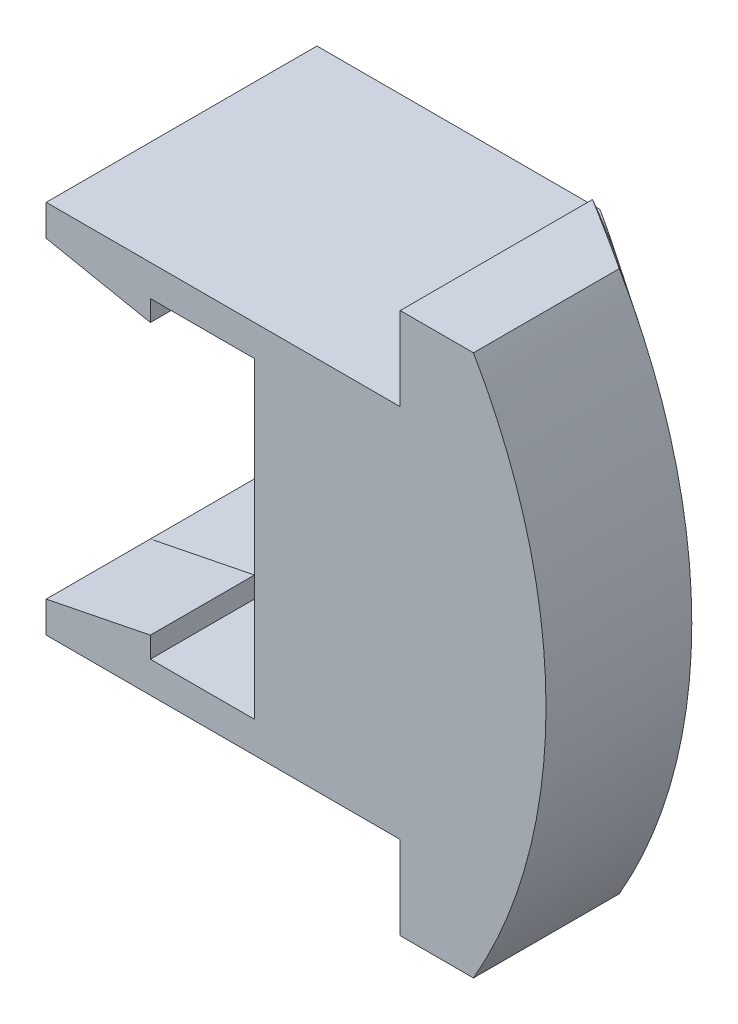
ISO-10303-21;
HEADER;
FILE_DESCRIPTION(('STEP AP214'),'2;1');
FILE_NAME('part.step','',(''),(''),'','','');
FILE_SCHEMA(('AUTOMOTIVE_DESIGN { 1 0 10303 214 1 1 1 1 }'));
ENDSEC;
DATA;
#1=APPLICATION_CONTEXT('core data for automotive mechanical design processes');
#2=APPLICATION_PROTOCOL_DEFINITION('international standard','automotive_design',2000,#1);
#3=PRODUCT_CONTEXT('',#1,'mechanical');
#4=PRODUCT('Part','Part','',(#3));
#5=PRODUCT_RELATED_PRODUCT_CATEGORY('part','',(#4));
#6=PRODUCT_DEFINITION_FORMATION('','',#4);
#7=PRODUCT_DEFINITION_CONTEXT('part definition',#1,'design');
#8=PRODUCT_DEFINITION('design','',#6,#7);
#9=PRODUCT_DEFINITION_SHAPE('','',#8);
#10=(LENGTH_UNIT() NAMED_UNIT(*) SI_UNIT(.MILLI.,.METRE.));
#11=(NAMED_UNIT(*) PLANE_ANGLE_UNIT() SI_UNIT($,.RADIAN.));
#12=(NAMED_UNIT(*) SI_UNIT($,.STERADIAN.) SOLID_ANGLE_UNIT());
#13=UNCERTAINTY_MEASURE_WITH_UNIT(LENGTH_MEASURE(1.E-05),#10,'distance_accuracy_value','');
#14=(GEOMETRIC_REPRESENTATION_CONTEXT(3) GLOBAL_UNCERTAINTY_ASSIGNED_CONTEXT((#13)) GLOBAL_UNIT_ASSIGNED_CONTEXT((#10,
#11,#12)) REPRESENTATION_CONTEXT('',''));
#15=CARTESIAN_POINT('',(0.,0.,0.));
#16=DIRECTION('',(0.,0.,1.));
#17=DIRECTION('',(1.,0.,0.));
#18=AXIS2_PLACEMENT_3D('',#15,#16,#17);
#19=CARTESIAN_POINT('',(-44.,-15.5,11.5));
#20=DIRECTION('',(0.,0.,1.));
#21=DIRECTION('',(1.,0.,0.));
#22=AXIS2_PLACEMENT_3D('',#19,#20,#21);
#23=PLANE('',#22);
#24=DIRECTION('',(-1.,0.,0.));
#25=VECTOR('',#24,1.);
#26=CARTESIAN_POINT('',(-44.,-13.5,11.5));
#27=LINE('',#26,#25);
#28=CARTESIAN_POINT('',(-19.5817691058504,-13.5,11.5));
#29=VERTEX_POINT('',#28);
#30=CARTESIAN_POINT('',(-30.5,-13.5,11.5));
#31=VERTEX_POINT('',#30);
#32=EDGE_CURVE('E406',#29,#31,#27,.T.);
#33=ORIENTED_EDGE('',*,*,#32,.F.);
#34=CARTESIAN_POINT('',(-44.,-15.5,11.5));
#35=DIRECTION('',(0.,0.,1.));
#36=DIRECTION('',(1.,0.,0.));
#37=AXIS2_PLACEMENT_3D('',#34,#35,#36);
#38=CIRCLE('',#37,24.5);
#39=CARTESIAN_POINT('',(-19.5204166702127,-16.5,11.5));
#40=VERTEX_POINT('',#39);
#41=EDGE_CURVE('E479',#40,#29,#38,.T.);
#42=ORIENTED_EDGE('',*,*,#41,.F.);
#43=DIRECTION('',(-1.,0.,0.));
#44=VECTOR('',#43,1.);
#45=CARTESIAN_POINT('',(-44.,-16.5,11.5));
#46=LINE('',#45,#44);
#47=CARTESIAN_POINT('',(-30.5,-16.5,11.5));
#48=VERTEX_POINT('',#47);
#49=EDGE_CURVE('E446',#40,#48,#46,.T.);
#50=ORIENTED_EDGE('',*,*,#49,.T.);
#51=DIRECTION('',(0.,1.,0.));
#52=VECTOR('',#51,1.);
#53=CARTESIAN_POINT('',(-30.5,-8.,11.5));
#54=LINE('',#53,#52);
#55=EDGE_CURVE('E494',#48,#31,#54,.T.);
#56=ORIENTED_EDGE('',*,*,#55,.T.);
#57=EDGE_LOOP('',(#33,#42,#50,#56));
#58=FACE_BOUND('',#57,.T.);
#59=ADVANCED_FACE('F33',(#58),#23,.F.);
#60=CARTESIAN_POINT('',(-30.5,-8.,13.));
#61=DIRECTION('',(-1.,0.,0.));
#62=DIRECTION('',(0.,-1.,0.));
#63=AXIS2_PLACEMENT_3D('',#60,#61,#62);
#64=PLANE('',#63);
#65=DIRECTION('',(0.,0.,-1.));
#66=VECTOR('',#65,1.);
#67=CARTESIAN_POINT('',(-30.5,-13.5,13.));
#68=LINE('',#67,#66);
#69=CARTESIAN_POINT('',(-30.5,-13.5,0.));
#70=VERTEX_POINT('',#69);
#71=EDGE_CURVE('E42',#31,#70,#68,.T.);
#72=ORIENTED_EDGE('',*,*,#71,.F.);
#73=ORIENTED_EDGE('',*,*,#55,.F.);
#74=DIRECTION('',(0.,0.,-1.));
#75=VECTOR('',#74,1.);
#76=CARTESIAN_POINT('',(-30.5,-16.5,13.));
#77=LINE('',#76,#75);
#78=CARTESIAN_POINT('',(-30.5,-16.5,0.));
#79=VERTEX_POINT('',#78);
#80=EDGE_CURVE('E396',#48,#79,#77,.T.);
#81=ORIENTED_EDGE('',*,*,#80,.T.);
#82=DIRECTION('',(0.,-1.,0.));
#83=VECTOR('',#82,1.);
#84=CARTESIAN_POINT('',(-30.5,-15.5,0.));
#85=LINE('',#84,#83);
#86=EDGE_CURVE('E499',#70,#79,#85,.T.);
#87=ORIENTED_EDGE('',*,*,#86,.F.);
#88=EDGE_LOOP('',(#72,#73,#81,#87));
#89=FACE_BOUND('',#88,.T.);
#90=ADVANCED_FACE('F587',(#89),#64,.F.);
#91=DIRECTION('',(-1.,0.,0.));
#92=VECTOR('',#91,1.);
#93=CARTESIAN_POINT('',(-44.,-18.,11.5));
#94=LINE('',#93,#92);
#95=CARTESIAN_POINT('',(-19.6278847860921,-18.,11.5));
#96=VERTEX_POINT('',#95);
#97=CARTESIAN_POINT('',(-30.5,-18.,11.5));
#98=VERTEX_POINT('',#97);
#99=EDGE_CURVE('E441',#96,#98,#94,.T.);
#100=ORIENTED_EDGE('',*,*,#99,.F.);
#101=CARTESIAN_POINT('',(-22.366692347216,-27.,11.5));
#102=VERTEX_POINT('',#101);
#103=EDGE_CURVE('E475',#102,#96,#38,.T.);
#104=ORIENTED_EDGE('',*,*,#103,.F.);
#105=DIRECTION('',(1.,0.,0.));
#106=VECTOR('',#105,1.);
#107=CARTESIAN_POINT('',(-25.,-27.,11.5));
#108=LINE('',#107,#106);
#109=CARTESIAN_POINT('',(-23.5,-27.,11.5));
#110=VERTEX_POINT('',#109);
#111=EDGE_CURVE('E467',#110,#102,#108,.T.);
#112=ORIENTED_EDGE('',*,*,#111,.F.);
#113=DIRECTION('',(0.,-1.,0.));
#114=VECTOR('',#113,1.);
#115=CARTESIAN_POINT('',(-23.5,-24.5,11.5));
#116=LINE('',#115,#114);
#117=CARTESIAN_POINT('',(-23.5,-23.,11.5));
#118=VERTEX_POINT('',#117);
#119=EDGE_CURVE('E461',#118,#110,#116,.T.);
#120=ORIENTED_EDGE('',*,*,#119,.F.);
#121=DIRECTION('',(1.,0.,0.));
#122=VECTOR('',#121,1.);
#123=CARTESIAN_POINT('',(-42.,-23.,11.5));
#124=LINE('',#123,#122);
#125=CARTESIAN_POINT('',(-30.5,-23.,11.5));
#126=VERTEX_POINT('',#125);
#127=EDGE_CURVE('E459',#126,#118,#124,.T.);
#128=ORIENTED_EDGE('',*,*,#127,.F.);
#129=EDGE_CURVE('E490',#126,#98,#54,.T.);
#130=ORIENTED_EDGE('',*,*,#129,.T.);
#131=EDGE_LOOP('',(#100,#104,#112,#120,#128,#130));
#132=FACE_BOUND('',#131,.T.);
#133=ADVANCED_FACE('F582',(#132),#23,.F.);
#134=DIRECTION('',(0.,0.,-1.));
#135=VECTOR('',#134,1.);
#136=CARTESIAN_POINT('',(-30.5,-18.,13.));
#137=LINE('',#136,#135);
#138=CARTESIAN_POINT('',(-30.5,-18.,0.));
#139=VERTEX_POINT('',#138);
#140=EDGE_CURVE('E388',#98,#139,#137,.T.);
#141=ORIENTED_EDGE('',*,*,#140,.F.);
#142=ORIENTED_EDGE('',*,*,#129,.F.);
#143=DIRECTION('',(0.,0.,-1.));
#144=VECTOR('',#143,1.);
#145=CARTESIAN_POINT('',(-30.5,-23.,13.));
#146=LINE('',#145,#144);
#147=CARTESIAN_POINT('',(-30.5,-23.,0.));
#148=VERTEX_POINT('',#147);
#149=EDGE_CURVE('E635',#126,#148,#146,.T.);
#150=ORIENTED_EDGE('',*,*,#149,.T.);
#151=EDGE_CURVE('E493',#139,#148,#85,.T.);
#152=ORIENTED_EDGE('',*,*,#151,.F.);
#153=EDGE_LOOP('',(#141,#142,#150,#152));
#154=FACE_BOUND('',#153,.T.);
#155=ADVANCED_FACE('F588',(#154),#64,.F.);
#156=CARTESIAN_POINT('',(-44.,-15.5,6.));
#157=DIRECTION('',(0.,0.,1.));
#158=DIRECTION('',(1.,0.,0.));
#159=AXIS2_PLACEMENT_3D('',#156,#157,#158);
#160=CONICAL_SURFACE('',#159,26.,0.927295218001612);
#161=CARTESIAN_POINT('',(-21.4833395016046,-2.49999999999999,6.));
#162=CARTESIAN_POINT('',(-21.774500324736,-2.49999999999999,5.81088956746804));
#163=CARTESIAN_POINT('',(-22.0660770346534,-2.5,5.6224179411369));
#164=CARTESIAN_POINT('',(-22.6501394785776,-2.5,5.24690771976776));
#165=CARTESIAN_POINT('',(-22.9426251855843,-2.5,5.05986908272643));
#166=CARTESIAN_POINT('',(-23.5286014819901,-2.5,4.68736816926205));
#167=CARTESIAN_POINT('',(-23.822092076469,-2.5,4.50190590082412));
#168=CARTESIAN_POINT('',(-24.4101872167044,-2.5,4.13273708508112));
#169=CARTESIAN_POINT('',(-24.7047917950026,-2.5,3.94903058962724));
#170=CARTESIAN_POINT('',(-25.,-2.5,3.766296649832));
#171=B_SPLINE_CURVE_WITH_KNOTS('',3,(#161,#162,#163,#164,#165,#166,#167,#168,#169,#170),
.UNSPECIFIED.,.F.,.F.,(4,2,2,2,4),(0.,1.04155514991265,2.08307965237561,3.12460942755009,
4.16616986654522),.UNSPECIFIED.);
#172=CARTESIAN_POINT('',(-21.4833395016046,-2.49999999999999,6.));
#173=VERTEX_POINT('',#172);
#174=CARTESIAN_POINT('',(-25.,-2.5,3.766296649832));
#175=VERTEX_POINT('',#174);
#176=EDGE_CURVE('E347',#173,#175,#171,.T.);
#177=ORIENTED_EDGE('',*,*,#176,.F.);
#178=CARTESIAN_POINT('',(-44.,-15.5,6.));
#179=DIRECTION('',(0.,0.,1.));
#180=DIRECTION('',(1.,0.,0.));
#181=AXIS2_PLACEMENT_3D('',#178,#179,#180);
#182=CIRCLE('',#181,26.);
#183=CARTESIAN_POINT('',(-21.4833395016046,-28.5,6.));
#184=VERTEX_POINT('',#183);
#185=EDGE_CURVE('E345',#184,#173,#182,.T.);
#186=ORIENTED_EDGE('',*,*,#185,.F.);
#187=CARTESIAN_POINT('',(-25.,-28.5,3.76629664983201));
#188=CARTESIAN_POINT('',(-24.7047917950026,-28.5,3.94903058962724));
#189=CARTESIAN_POINT('',(-24.4101872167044,-28.5,4.13273708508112));
#190=CARTESIAN_POINT('',(-23.822092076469,-28.5,4.50190590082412));
#191=CARTESIAN_POINT('',(-23.5286014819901,-28.5,4.68736816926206));
#192=CARTESIAN_POINT('',(-22.9426251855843,-28.5,5.05986908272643));
#193=CARTESIAN_POINT('',(-22.6501394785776,-28.5,5.24690771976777));
#194=CARTESIAN_POINT('',(-22.0660770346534,-28.5,5.6224179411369));
#195=CARTESIAN_POINT('',(-21.774500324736,-28.5,5.81088956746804));
#196=CARTESIAN_POINT('',(-21.4833395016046,-28.5,6.));
#197=B_SPLINE_CURVE_WITH_KNOTS('',3,(#187,#188,#189,#190,#191,#192,#193,#194,#195,#196),
.UNSPECIFIED.,.F.,.F.,(4,2,2,2,4),(0.,1.04156043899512,2.08309021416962,3.12461471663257,
4.16616986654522),.UNSPECIFIED.);
#198=CARTESIAN_POINT('',(-25.,-28.5,3.76629664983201));
#199=VERTEX_POINT('',#198);
#200=EDGE_CURVE('E382',#199,#184,#197,.T.);
#201=ORIENTED_EDGE('',*,*,#200,.F.);
#202=CARTESIAN_POINT('',(-25.,-24.5,2.26784703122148));
#203=CARTESIAN_POINT('',(-25.,-24.8391366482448,2.3767393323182));
#204=CARTESIAN_POINT('',(-25.,-25.1767945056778,2.49016864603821));
#205=CARTESIAN_POINT('',(-25.,-25.8490549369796,2.72523121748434));
#206=CARTESIAN_POINT('',(-25.,-26.1836589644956,2.84686031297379));
#207=CARTESIAN_POINT('',(-25.,-26.8500325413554,3.0975550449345));
#208=CARTESIAN_POINT('',(-25.,-27.1818022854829,3.22662016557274));
#209=CARTESIAN_POINT('',(-25.,-27.8428127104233,3.49154920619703));
#210=CARTESIAN_POINT('',(-25.,-28.1720520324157,3.62741651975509));
#211=CARTESIAN_POINT('',(-25.,-28.5,3.766296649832));
#212=B_SPLINE_CURVE_WITH_KNOTS('',3,(#202,#203,#204,#205,#206,#207,#208,#209,#210,#211),
.UNSPECIFIED.,.F.,.F.,(4,2,2,2,4),(0.,1.06850746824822,2.13647658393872,3.20437170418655,
4.27280500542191),.UNSPECIFIED.);
#213=CARTESIAN_POINT('',(-25.,-24.5,2.26784703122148));
#214=VERTEX_POINT('',#213);
#215=EDGE_CURVE('E389',#214,#199,#212,.T.);
#216=ORIENTED_EDGE('',*,*,#215,.F.);
#217=CARTESIAN_POINT('',(-28.4115427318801,-24.5,0.));
#218=CARTESIAN_POINT('',(-28.1252468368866,-24.5,0.185963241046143));
#219=CARTESIAN_POINT('',(-27.8395292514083,-24.5,0.372814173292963));
#220=CARTESIAN_POINT('',(-27.2691356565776,-24.5,0.748084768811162));
#221=CARTESIAN_POINT('',(-26.9844596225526,-24.5,0.936504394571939));
#222=CARTESIAN_POINT('',(-26.4160219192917,-24.5,1.31471363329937));
#223=CARTESIAN_POINT('',(-26.1322602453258,-24.5,1.50450323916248));
#224=CARTESIAN_POINT('',(-25.5655459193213,-24.5,1.88530127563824));
#225=CARTESIAN_POINT('',(-25.2825932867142,-24.5,2.07630973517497));
#226=CARTESIAN_POINT('',(-25.,-24.5,2.26784703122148));
#227=B_SPLINE_CURVE_WITH_KNOTS('',3,(#217,#218,#219,#220,#221,#222,#223,#224,#225,#226),
.UNSPECIFIED.,.F.,.F.,(4,2,2,2,4),(0.,1.02416864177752,2.04831286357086,3.07245177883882,
4.09661508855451),.UNSPECIFIED.);
#228=CARTESIAN_POINT('',(-28.4115427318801,-24.5,0.));
#229=VERTEX_POINT('',#228);
#230=EDGE_CURVE('E999',#229,#214,#227,.T.);
#231=ORIENTED_EDGE('',*,*,#230,.F.);
#232=CARTESIAN_POINT('',(-44.,-15.5,0.));
#233=DIRECTION('',(0.,0.,1.));
#234=DIRECTION('',(1.,0.,0.));
#235=AXIS2_PLACEMENT_3D('',#232,#233,#234);
#236=CIRCLE('',#235,18.);
#237=CARTESIAN_POINT('',(-27.6369318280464,-23.,0.));
#238=VERTEX_POINT('',#237);
#239=EDGE_CURVE('E997',#238,#229,#236,.F.);
#240=ORIENTED_EDGE('',*,*,#239,.F.);
#241=CARTESIAN_POINT('',(-9.26418985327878,-23.,13.1522027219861));
#242=CARTESIAN_POINT('',(-9.9763435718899,-23.,12.6301332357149));
#243=CARTESIAN_POINT('',(-10.6888251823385,-23.,12.1085102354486));
#244=CARTESIAN_POINT('',(-12.1146125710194,-23.,11.0663873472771));
#245=CARTESIAN_POINT('',(-12.8279183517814,-23.,10.5458874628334));
#246=CARTESIAN_POINT('',(-14.2555696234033,-23.,9.50620662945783));
#247=CARTESIAN_POINT('',(-14.9699151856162,-23.,8.98702577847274));
#248=CARTESIAN_POINT('',(-16.3998230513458,-23.,7.95034365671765));
#249=CARTESIAN_POINT('',(-17.1153853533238,-23.,7.43284238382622));
#250=CARTESIAN_POINT('',(-18.5475149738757,-23.,6.40031511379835));
#251=CARTESIAN_POINT('',(-19.264081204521,-23.,5.88528760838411));
#252=CARTESIAN_POINT('',(-20.6991356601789,-23.,4.85791774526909));
#253=CARTESIAN_POINT('',(-21.4176238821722,-23.,4.34557538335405));
#254=CARTESIAN_POINT('',(-22.8570823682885,-23.,3.32439705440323));
#255=CARTESIAN_POINT('',(-23.578052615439,-23.,2.81556106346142));
#256=CARTESIAN_POINT('',(-25.0232727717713,-23.,1.80257065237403));
#257=CARTESIAN_POINT('',(-25.7475226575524,-23.,1.29841619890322));
#258=CARTESIAN_POINT('',(-27.0932875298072,-23.,0.370492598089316));
#259=CARTESIAN_POINT('',(-27.7141922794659,-23.,-0.0541607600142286));
#260=CARTESIAN_POINT('',(-28.9602796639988,-23.,-0.897088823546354));
#261=CARTESIAN_POINT('',(-29.5854620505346,-23.,-1.31536389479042));
#262=CARTESIAN_POINT('',(-30.5277517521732,-23.,-1.93614987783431));
#263=CARTESIAN_POINT('',(-30.8426537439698,-23.,-2.14200778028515));
#264=CARTESIAN_POINT('',(-31.4742025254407,-23.,-2.55102183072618));
#265=CARTESIAN_POINT('',(-31.7908492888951,-23.,-2.75417801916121));
#266=CARTESIAN_POINT('',(-32.426268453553,-23.,-3.15727444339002));
#267=CARTESIAN_POINT('',(-32.7450412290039,-23.,-3.357214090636));
#268=CARTESIAN_POINT('',(-33.3850995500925,-23.,-3.75306387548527));
#269=CARTESIAN_POINT('',(-33.7063852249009,-23.,-3.94897380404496));
#270=CARTESIAN_POINT('',(-34.02913282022,-23.,-4.14247050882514));
#271=B_SPLINE_CURVE_WITH_KNOTS('',3,(#241,#242,#243,#244,#245,#246,#247,#248,#249,#250,#251,
#252,#253,#254,#255,#256,#257,#258,#259,#260,#261,#262,#263,#264,#265,#266,#267,#268,#269,#270),
.UNSPECIFIED.,.F.,.F.,(4,2,2,2,2,2,2,2,2,2,2,2,2,2,4),(0.,2.6490522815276,5.29811271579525,
7.94736442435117,10.5966127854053,13.243962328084,15.8913077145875,18.5386350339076,
21.185943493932,23.4426147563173,25.6991561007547,26.8278021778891,27.9564313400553,
29.0852647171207,30.2141565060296),.UNSPECIFIED.);
#272=CARTESIAN_POINT('',(-23.5,-23.,2.8716599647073));
#273=VERTEX_POINT('',#272);
#274=EDGE_CURVE('E511',#238,#273,#271,.F.);
#275=ORIENTED_EDGE('',*,*,#274,.T.);
#276=CARTESIAN_POINT('',(-23.5,-23.,2.8716599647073));
#277=CARTESIAN_POINT('',(-23.5,-23.3386279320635,2.95892009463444));
#278=CARTESIAN_POINT('',(-23.5,-23.6759769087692,3.05106209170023));
#279=CARTESIAN_POINT('',(-23.5,-24.3478765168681,3.24430570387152));
#280=CARTESIAN_POINT('',(-23.5,-24.6824287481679,3.3454017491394));
#281=CARTESIAN_POINT('',(-23.5,-25.3488894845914,3.55585160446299));
#282=CARTESIAN_POINT('',(-23.5,-25.6807981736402,3.66520483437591));
#283=CARTESIAN_POINT('',(-23.5,-26.3422321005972,3.89155121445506));
#284=CARTESIAN_POINT('',(-23.5,-26.6717557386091,4.00854904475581));
#285=CARTESIAN_POINT('',(-23.5,-27.,4.12898891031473));
#286=B_SPLINE_CURVE_WITH_KNOTS('',3,(#276,#277,#278,#279,#280,#281,#282,#283,#284,#285),
.UNSPECIFIED.,.F.,.F.,(4,2,2,2,4),(0.,1.04900497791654,2.09736194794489,3.14564532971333,
4.19457661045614),.UNSPECIFIED.);
#287=CARTESIAN_POINT('',(-23.5,-27.,4.12898891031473));
#288=VERTEX_POINT('',#287);
#289=EDGE_CURVE('E556',#273,#288,#286,.T.);
#290=ORIENTED_EDGE('',*,*,#289,.T.);
#291=CARTESIAN_POINT('',(-23.5,-27.,4.12898891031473));
#292=CARTESIAN_POINT('',(-23.3107626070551,-27.,4.25278817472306));
#293=CARTESIAN_POINT('',(-23.1217016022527,-27.,4.3768554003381));
#294=CARTESIAN_POINT('',(-22.7439323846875,-27.,4.62552576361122));
#295=CARTESIAN_POINT('',(-22.5552241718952,-27.,4.7501289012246));
#296=CARTESIAN_POINT('',(-22.366692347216,-27.,4.875));
#297=B_SPLINE_CURVE_WITH_KNOTS('',3,(#291,#292,#293,#294,#295,#296),.UNSPECIFIED.,.F.,.F.,(4,2,
4),(0.,0.678403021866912,1.3568059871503),.UNSPECIFIED.);
#298=CARTESIAN_POINT('',(-22.366692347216,-27.,4.875));
#299=VERTEX_POINT('',#298);
#300=EDGE_CURVE('E549',#288,#299,#297,.T.);
#301=ORIENTED_EDGE('',*,*,#300,.T.);
#302=CARTESIAN_POINT('',(-44.,-15.5,4.875));
#303=DIRECTION('',(0.,0.,1.));
#304=DIRECTION('',(1.,0.,0.));
#305=AXIS2_PLACEMENT_3D('',#302,#303,#304);
#306=CIRCLE('',#305,24.5);
#307=CARTESIAN_POINT('',(-22.366692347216,-4.,4.875));
#308=VERTEX_POINT('',#307);
#309=EDGE_CURVE('E483',#299,#308,#306,.T.);
#310=ORIENTED_EDGE('',*,*,#309,.T.);
#311=CARTESIAN_POINT('',(-22.366692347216,-4.,4.875));
#312=CARTESIAN_POINT('',(-22.5552241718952,-4.,4.7501289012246));
#313=CARTESIAN_POINT('',(-22.7439323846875,-4.,4.62552576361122));
#314=CARTESIAN_POINT('',(-23.1217016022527,-4.,4.3768554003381));
#315=CARTESIAN_POINT('',(-23.3107626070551,-4.,4.25278817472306));
#316=CARTESIAN_POINT('',(-23.5,-4.,4.12898891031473));
#317=B_SPLINE_CURVE_WITH_KNOTS('',3,(#311,#312,#313,#314,#315,#316),.UNSPECIFIED.,.F.,.F.,(4,2,
4),(0.,0.678402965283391,1.35680598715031),.UNSPECIFIED.);
#318=CARTESIAN_POINT('',(-23.5,-4.,4.12898891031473));
#319=VERTEX_POINT('',#318);
#320=EDGE_CURVE('E541',#308,#319,#317,.T.);
#321=ORIENTED_EDGE('',*,*,#320,.T.);
#322=CARTESIAN_POINT('',(-23.5,-4.,4.12898891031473));
#323=CARTESIAN_POINT('',(-23.5,-4.32824426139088,4.00854904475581));
#324=CARTESIAN_POINT('',(-23.5,-4.65776789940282,3.89155121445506));
#325=CARTESIAN_POINT('',(-23.5,-5.31920182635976,3.66520483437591));
#326=CARTESIAN_POINT('',(-23.5,-5.65111051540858,3.55585160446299));
#327=CARTESIAN_POINT('',(-23.5,-6.3175712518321,3.3454017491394));
#328=CARTESIAN_POINT('',(-23.5,-6.65212348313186,3.24430570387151));
#329=CARTESIAN_POINT('',(-23.5,-7.32402309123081,3.05106209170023));
#330=CARTESIAN_POINT('',(-23.5,-7.66137206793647,2.95892009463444));
#331=CARTESIAN_POINT('',(-23.5,-7.99999999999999,2.8716599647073));
#332=B_SPLINE_CURVE_WITH_KNOTS('',3,(#322,#323,#324,#325,#326,#327,#328,#329,#330,#331),
.UNSPECIFIED.,.F.,.F.,(4,2,2,2,4),(0.,1.04893128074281,2.09721466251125,3.14557163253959,
4.19457661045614),.UNSPECIFIED.);
#333=CARTESIAN_POINT('',(-23.5,-7.99999999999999,2.8716599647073));
#334=VERTEX_POINT('',#333);
#335=EDGE_CURVE('E512',#319,#334,#332,.T.);
#336=ORIENTED_EDGE('',*,*,#335,.T.);
#337=CARTESIAN_POINT('',(-23.5,-7.99999999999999,2.8716599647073));
#338=CARTESIAN_POINT('',(-23.843106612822,-7.99999999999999,2.63000270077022));
#339=CARTESIAN_POINT('',(-24.186544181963,-7.99999999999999,2.38881426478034));
#340=CARTESIAN_POINT('',(-24.8741899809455,-7.99999999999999,1.90754915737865));
#341=CARTESIAN_POINT('',(-25.2183981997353,-7.99999999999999,1.66747247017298));
#342=CARTESIAN_POINT('',(-25.9077051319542,-7.99999999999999,1.18859715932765));
#343=CARTESIAN_POINT('',(-26.2528038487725,-8.,0.949798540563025));
#344=CARTESIAN_POINT('',(-26.9440469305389,-8.,0.473709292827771));
#345=CARTESIAN_POINT('',(-27.2901913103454,-8.,0.236418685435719));
#346=CARTESIAN_POINT('',(-27.6369318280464,-8.,0.));
#347=B_SPLINE_CURVE_WITH_KNOTS('',3,(#337,#338,#339,#340,#341,#342,#343,#344,#345,#346),
.UNSPECIFIED.,.F.,.F.,(4,2,2,2,4),(0.,1.2590014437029,2.51798494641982,3.77697324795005,
5.03597952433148),.UNSPECIFIED.);
#348=CARTESIAN_POINT('',(-27.6369318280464,-8.,0.));
#349=VERTEX_POINT('',#348);
#350=EDGE_CURVE('E503',#334,#349,#347,.T.);
#351=ORIENTED_EDGE('',*,*,#350,.T.);
#352=CARTESIAN_POINT('',(-28.4115427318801,-6.5,0.));
#353=VERTEX_POINT('',#352);
#354=EDGE_CURVE('E1000',#353,#349,#236,.F.);
#355=ORIENTED_EDGE('',*,*,#354,.F.);
#356=CARTESIAN_POINT('',(-25.,-6.5,2.26784703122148));
#357=CARTESIAN_POINT('',(-25.2825932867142,-6.5,2.07630973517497));
#358=CARTESIAN_POINT('',(-25.5655459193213,-6.5,1.88530127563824));
#359=CARTESIAN_POINT('',(-26.1322602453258,-6.5,1.50450323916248));
#360=CARTESIAN_POINT('',(-26.4160219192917,-6.5,1.31471363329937));
#361=CARTESIAN_POINT('',(-26.9844596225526,-6.5,0.936504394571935));
#362=CARTESIAN_POINT('',(-27.2691356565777,-6.5,0.748084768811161));
#363=CARTESIAN_POINT('',(-27.8395292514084,-6.5,0.372814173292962));
#364=CARTESIAN_POINT('',(-28.1252468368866,-6.5,0.185963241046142));
#365=CARTESIAN_POINT('',(-28.4115427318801,-6.5,0.));
#366=B_SPLINE_CURVE_WITH_KNOTS('',3,(#356,#357,#358,#359,#360,#361,#362,#363,#364,#365),
.UNSPECIFIED.,.F.,.F.,(4,2,2,2,4),(0.,1.02416330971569,2.04830222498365,3.07244644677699,
4.09661508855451),.UNSPECIFIED.);
#367=CARTESIAN_POINT('',(-25.,-6.5,2.26784703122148));
#368=VERTEX_POINT('',#367);
#369=EDGE_CURVE('E1001',#368,#353,#366,.T.);
#370=ORIENTED_EDGE('',*,*,#369,.F.);
#371=CARTESIAN_POINT('',(-25.,-2.5,3.766296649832));
#372=CARTESIAN_POINT('',(-25.,-2.8279479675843,3.62741651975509));
#373=CARTESIAN_POINT('',(-25.,-3.15718728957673,3.49154920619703));
#374=CARTESIAN_POINT('',(-25.,-3.81819771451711,3.22662016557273));
#375=CARTESIAN_POINT('',(-25.,-4.14996745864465,3.09755504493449));
#376=CARTESIAN_POINT('',(-25.,-4.81634103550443,2.84686031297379));
#377=CARTESIAN_POINT('',(-25.,-5.1509450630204,2.72523121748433));
#378=CARTESIAN_POINT('',(-25.,-5.82320549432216,2.4901686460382));
#379=CARTESIAN_POINT('',(-25.,-6.16086335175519,2.3767393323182));
#380=CARTESIAN_POINT('',(-25.,-6.49999999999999,2.26784703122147));
#381=B_SPLINE_CURVE_WITH_KNOTS('',3,(#371,#372,#373,#374,#375,#376,#377,#378,#379,#380),
.UNSPECIFIED.,.F.,.F.,(4,2,2,2,4),(0.,1.06843330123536,2.13632842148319,3.2042975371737,
4.27280500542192),.UNSPECIFIED.);
#382=EDGE_CURVE('E354',#175,#368,#381,.T.);
#383=ORIENTED_EDGE('',*,*,#382,.F.);
#384=EDGE_LOOP('',(#177,#186,#201,#216,#231,#240,#275,#290,#301,#310,#321,#336,#351,#355,#370,#383));
#385=FACE_BOUND('',#384,.T.);
#386=ADVANCED_FACE('F359',(#385),#160,.T.);
#387=CARTESIAN_POINT('',(-42.,-6.50000000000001,13.));
#388=DIRECTION('',(1.,0.,0.));
#389=DIRECTION('',(0.,1.,0.));
#390=AXIS2_PLACEMENT_3D('',#387,#388,#389);
#391=PLANE('',#390);
#392=DIRECTION('',(0.,-1.,0.));
#393=VECTOR('',#392,1.);
#394=CARTESIAN_POINT('',(-42.,-6.50000000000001,13.));
#395=LINE('',#394,#393);
#396=CARTESIAN_POINT('',(-42.,-23.,13.));
#397=VERTEX_POINT('',#396);
#398=CARTESIAN_POINT('',(-42.,-24.5,13.));
#399=VERTEX_POINT('',#398);
#400=EDGE_CURVE('E308',#397,#399,#395,.T.);
#401=ORIENTED_EDGE('',*,*,#400,.F.);
#402=DIRECTION('',(0.,0.,1.));
#403=VECTOR('',#402,1.);
#404=CARTESIAN_POINT('',(-42.,-23.,8.));
#405=LINE('',#404,#403);
#406=CARTESIAN_POINT('',(-42.,-23.,8.));
#407=VERTEX_POINT('',#406);
#408=EDGE_CURVE('E943',#407,#397,#405,.T.);
#409=ORIENTED_EDGE('',*,*,#408,.F.);
#410=DIRECTION('',(0.,0.,1.));
#411=VECTOR('',#410,1.);
#412=CARTESIAN_POINT('',(-42.,-23.,13.));
#413=LINE('',#412,#411);
#414=CARTESIAN_POINT('',(-42.,-23.,0.));
#415=VERTEX_POINT('',#414);
#416=EDGE_CURVE('E947',#415,#407,#413,.T.);
#417=ORIENTED_EDGE('',*,*,#416,.F.);
#418=DIRECTION('',(0.,-1.,0.));
#419=VECTOR('',#418,1.);
#420=CARTESIAN_POINT('',(-42.,-6.50000000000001,0.));
#421=LINE('',#420,#419);
#422=CARTESIAN_POINT('',(-42.,-24.5,0.));
#423=VERTEX_POINT('',#422);
#424=EDGE_CURVE('E286',#415,#423,#421,.T.);
#425=ORIENTED_EDGE('',*,*,#424,.T.);
#426=DIRECTION('',(0.,0.,-1.));
#427=VECTOR('',#426,1.);
#428=CARTESIAN_POINT('',(-42.,-24.5,13.));
#429=LINE('',#428,#427);
#430=EDGE_CURVE('E336',#399,#423,#429,.T.);
#431=ORIENTED_EDGE('',*,*,#430,.F.);
#432=EDGE_LOOP('',(#401,#409,#417,#425,#431));
#433=FACE_BOUND('',#432,.T.);
#434=ADVANCED_FACE('F698',(#433),#391,.F.);
#435=CARTESIAN_POINT('',(-25.,-6.5,13.));
#436=DIRECTION('',(1.,0.,0.));
#437=DIRECTION('',(0.,0.,-1.));
#438=AXIS2_PLACEMENT_3D('',#435,#436,#437);
#439=PLANE('',#438);
#440=DIRECTION('',(0.,0.,-1.));
#441=VECTOR('',#440,1.);
#442=CARTESIAN_POINT('',(-25.,-2.5,13.));
#443=LINE('',#442,#441);
#444=CARTESIAN_POINT('',(-25.,-2.5,13.));
#445=VERTEX_POINT('',#444);
#446=EDGE_CURVE('E321',#445,#175,#443,.T.);
#447=ORIENTED_EDGE('',*,*,#446,.T.);
#448=ORIENTED_EDGE('',*,*,#382,.T.);
#449=DIRECTION('',(0.,0.,-1.));
#450=VECTOR('',#449,1.);
#451=CARTESIAN_POINT('',(-25.,-6.5,13.));
#452=LINE('',#451,#450);
#453=CARTESIAN_POINT('',(-25.,-6.5,13.));
#454=VERTEX_POINT('',#453);
#455=EDGE_CURVE('E342',#454,#368,#452,.T.);
#456=ORIENTED_EDGE('',*,*,#455,.F.);
#457=DIRECTION('',(0.,-1.,0.));
#458=VECTOR('',#457,1.);
#459=CARTESIAN_POINT('',(-25.,-6.5,13.));
#460=LINE('',#459,#458);
#461=EDGE_CURVE('E303',#445,#454,#460,.T.);
#462=ORIENTED_EDGE('',*,*,#461,.F.);
#463=EDGE_LOOP('',(#447,#448,#456,#462));
#464=FACE_BOUND('',#463,.T.);
#465=ADVANCED_FACE('F35',(#464),#439,.F.);
#466=CARTESIAN_POINT('',(-25.,-6.5,13.));
#467=DIRECTION('',(0.,-1.,0.));
#468=DIRECTION('',(1.,0.,0.));
#469=AXIS2_PLACEMENT_3D('',#466,#467,#468);
#470=PLANE('',#469);
#471=ORIENTED_EDGE('',*,*,#455,.T.);
#472=ORIENTED_EDGE('',*,*,#369,.T.);
#473=DIRECTION('',(-1.,0.,0.));
#474=VECTOR('',#473,1.);
#475=CARTESIAN_POINT('',(-25.,-6.5,0.));
#476=LINE('',#475,#474);
#477=CARTESIAN_POINT('',(-42.,-6.50000000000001,0.));
#478=VERTEX_POINT('',#477);
#479=EDGE_CURVE('E283',#353,#478,#476,.T.);
#480=ORIENTED_EDGE('',*,*,#479,.T.);
#481=DIRECTION('',(0.,0.,-1.));
#482=VECTOR('',#481,1.);
#483=CARTESIAN_POINT('',(-42.,-6.50000000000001,13.));
#484=LINE('',#483,#482);
#485=CARTESIAN_POINT('',(-42.,-6.50000000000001,13.));
#486=VERTEX_POINT('',#485);
#487=EDGE_CURVE('E339',#486,#478,#484,.T.);
#488=ORIENTED_EDGE('',*,*,#487,.F.);
#489=DIRECTION('',(-1.,0.,0.));
#490=VECTOR('',#489,1.);
#491=CARTESIAN_POINT('',(-25.,-6.5,13.));
#492=LINE('',#491,#490);
#493=EDGE_CURVE('E306',#454,#486,#492,.T.);
#494=ORIENTED_EDGE('',*,*,#493,.F.);
#495=EDGE_LOOP('',(#471,#472,#480,#488,#494));
#496=FACE_BOUND('',#495,.T.);
#497=ADVANCED_FACE('F695',(#496),#470,.F.);
#498=CARTESIAN_POINT('',(-42.,-8.00000000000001,0.));
#499=VERTEX_POINT('',#498);
#500=EDGE_CURVE('E297',#478,#499,#421,.T.);
#501=ORIENTED_EDGE('',*,*,#500,.T.);
#502=DIRECTION('',(0.,0.,-1.));
#503=VECTOR('',#502,1.);
#504=CARTESIAN_POINT('',(-42.,-8.00000000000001,13.));
#505=LINE('',#504,#503);
#506=CARTESIAN_POINT('',(-42.,-8.00000000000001,8.));
#507=VERTEX_POINT('',#506);
#508=EDGE_CURVE('E958',#507,#499,#505,.T.);
#509=ORIENTED_EDGE('',*,*,#508,.F.);
#510=CARTESIAN_POINT('',(-42.,-8.00000000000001,13.));
#511=VERTEX_POINT('',#510);
#512=EDGE_CURVE('E953',#511,#507,#505,.T.);
#513=ORIENTED_EDGE('',*,*,#512,.F.);
#514=EDGE_CURVE('E309',#486,#511,#395,.T.);
#515=ORIENTED_EDGE('',*,*,#514,.F.);
#516=ORIENTED_EDGE('',*,*,#487,.T.);
#517=EDGE_LOOP('',(#501,#509,#513,#515,#516));
#518=FACE_BOUND('',#517,.T.);
#519=ADVANCED_FACE('F688',(#518),#391,.F.);
#520=CARTESIAN_POINT('',(-42.,-24.5,13.));
#521=DIRECTION('',(0.,1.,0.));
#522=DIRECTION('',(0.,0.,1.));
#523=AXIS2_PLACEMENT_3D('',#520,#521,#522);
#524=PLANE('',#523);
#525=DIRECTION('',(1.,0.,0.));
#526=VECTOR('',#525,1.);
#527=CARTESIAN_POINT('',(-42.,-24.5,0.));
#528=LINE('',#527,#526);
#529=EDGE_CURVE('E300',#423,#229,#528,.T.);
#530=ORIENTED_EDGE('',*,*,#529,.T.);
#531=ORIENTED_EDGE('',*,*,#230,.T.);
#532=DIRECTION('',(0.,0.,-1.));
#533=VECTOR('',#532,1.);
#534=CARTESIAN_POINT('',(-25.,-24.5,13.));
#535=LINE('',#534,#533);
#536=CARTESIAN_POINT('',(-25.,-24.5,13.));
#537=VERTEX_POINT('',#536);
#538=EDGE_CURVE('E333',#537,#214,#535,.T.);
#539=ORIENTED_EDGE('',*,*,#538,.F.);
#540=DIRECTION('',(1.,0.,0.));
#541=VECTOR('',#540,1.);
#542=CARTESIAN_POINT('',(-42.,-24.5,13.));
#543=LINE('',#542,#541);
#544=EDGE_CURVE('E311',#399,#537,#543,.T.);
#545=ORIENTED_EDGE('',*,*,#544,.F.);
#546=ORIENTED_EDGE('',*,*,#430,.T.);
#547=EDGE_LOOP('',(#530,#531,#539,#545,#546));
#548=FACE_BOUND('',#547,.T.);
#549=ADVANCED_FACE('F681',(#548),#524,.F.);
#550=CARTESIAN_POINT('',(-25.,-24.5,13.));
#551=DIRECTION('',(1.,0.,0.));
#552=DIRECTION('',(0.,0.,-1.));
#553=AXIS2_PLACEMENT_3D('',#550,#551,#552);
#554=PLANE('',#553);
#555=ORIENTED_EDGE('',*,*,#538,.T.);
#556=ORIENTED_EDGE('',*,*,#215,.T.);
#557=DIRECTION('',(0.,0.,-1.));
#558=VECTOR('',#557,1.);
#559=CARTESIAN_POINT('',(-25.,-28.5,13.));
#560=LINE('',#559,#558);
#561=CARTESIAN_POINT('',(-25.,-28.5,13.));
#562=VERTEX_POINT('',#561);
#563=EDGE_CURVE('E330',#562,#199,#560,.T.);
#564=ORIENTED_EDGE('',*,*,#563,.F.);
#565=DIRECTION('',(0.,-1.,0.));
#566=VECTOR('',#565,1.);
#567=CARTESIAN_POINT('',(-25.,-24.5,13.));
#568=LINE('',#567,#566);
#569=EDGE_CURVE('E313',#537,#562,#568,.T.);
#570=ORIENTED_EDGE('',*,*,#569,.F.);
#571=EDGE_LOOP('',(#555,#556,#564,#570));
#572=FACE_BOUND('',#571,.T.);
#573=ADVANCED_FACE('F377',(#572),#554,.F.);
#574=CARTESIAN_POINT('',(-25.,-28.5,13.));
#575=DIRECTION('',(0.,1.,0.));
#576=DIRECTION('',(0.,0.,1.));
#577=AXIS2_PLACEMENT_3D('',#574,#575,#576);
#578=PLANE('',#577);
#579=ORIENTED_EDGE('',*,*,#563,.T.);
#580=ORIENTED_EDGE('',*,*,#200,.T.);
#581=DIRECTION('',(0.,0.,-1.));
#582=VECTOR('',#581,1.);
#583=CARTESIAN_POINT('',(-21.4833395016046,-28.5,13.));
#584=LINE('',#583,#582);
#585=CARTESIAN_POINT('',(-21.4833395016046,-28.5,13.));
#586=VERTEX_POINT('',#585);
#587=EDGE_CURVE('E327',#586,#184,#584,.T.);
#588=ORIENTED_EDGE('',*,*,#587,.F.);
#589=DIRECTION('',(1.,0.,0.));
#590=VECTOR('',#589,1.);
#591=CARTESIAN_POINT('',(-25.,-28.5,13.));
#592=LINE('',#591,#590);
#593=EDGE_CURVE('E315',#562,#586,#592,.T.);
#594=ORIENTED_EDGE('',*,*,#593,.F.);
#595=EDGE_LOOP('',(#579,#580,#588,#594));
#596=FACE_BOUND('',#595,.T.);
#597=ADVANCED_FACE('F372',(#596),#578,.F.);
#598=CARTESIAN_POINT('',(-44.,-15.5,13.));
#599=DIRECTION('',(0.,0.,-1.));
#600=DIRECTION('',(-1.,0.,0.));
#601=AXIS2_PLACEMENT_3D('',#598,#599,#600);
#602=CYLINDRICAL_SURFACE('',#601,26.);
#603=DIRECTION('',(0.,0.,-1.));
#604=VECTOR('',#603,1.);
#605=CARTESIAN_POINT('',(-21.4833395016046,-2.49999999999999,13.));
#606=LINE('',#605,#604);
#607=CARTESIAN_POINT('',(-21.4833395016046,-2.49999999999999,13.));
#608=VERTEX_POINT('',#607);
#609=EDGE_CURVE('E324',#608,#173,#606,.T.);
#610=ORIENTED_EDGE('',*,*,#609,.F.);
#611=CARTESIAN_POINT('',(-44.,-15.5,13.));
#612=DIRECTION('',(0.,0.,1.));
#613=DIRECTION('',(1.,0.,0.));
#614=AXIS2_PLACEMENT_3D('',#611,#612,#613);
#615=CIRCLE('',#614,26.);
#616=EDGE_CURVE('E317',#586,#608,#615,.T.);
#617=ORIENTED_EDGE('',*,*,#616,.F.);
#618=ORIENTED_EDGE('',*,*,#587,.T.);
#619=ORIENTED_EDGE('',*,*,#185,.T.);
#620=EDGE_LOOP('',(#610,#617,#618,#619));
#621=FACE_BOUND('',#620,.T.);
#622=ADVANCED_FACE('F368',(#621),#602,.T.);
#623=CARTESIAN_POINT('',(-25.,-2.5,13.));
#624=DIRECTION('',(0.,-1.,0.));
#625=DIRECTION('',(1.,0.,0.));
#626=AXIS2_PLACEMENT_3D('',#623,#624,#625);
#627=PLANE('',#626);
#628=ORIENTED_EDGE('',*,*,#609,.T.);
#629=ORIENTED_EDGE('',*,*,#176,.T.);
#630=ORIENTED_EDGE('',*,*,#446,.F.);
#631=DIRECTION('',(-1.,0.,0.));
#632=VECTOR('',#631,1.);
#633=CARTESIAN_POINT('',(-25.,-2.5,13.));
#634=LINE('',#633,#632);
#635=EDGE_CURVE('E319',#608,#445,#634,.T.);
#636=ORIENTED_EDGE('',*,*,#635,.F.);
#637=EDGE_LOOP('',(#628,#629,#630,#636));
#638=FACE_BOUND('',#637,.T.);
#639=ADVANCED_FACE('F363',(#638),#627,.F.);
#640=CARTESIAN_POINT('',(-44.,-15.5,13.));
#641=DIRECTION('',(0.,0.,1.));
#642=DIRECTION('',(1.,0.,0.));
#643=AXIS2_PLACEMENT_3D('',#640,#641,#642);
#644=PLANE('',#643);
#645=DIRECTION('',(-1.,0.,0.));
#646=VECTOR('',#645,1.);
#647=CARTESIAN_POINT('',(-32.,-8.,13.));
#648=LINE('',#647,#646);
#649=CARTESIAN_POINT('',(-32.,-8.,13.));
#650=VERTEX_POINT('',#649);
#651=CARTESIAN_POINT('',(-37.,-8.00000000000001,13.));
#652=VERTEX_POINT('',#651);
#653=EDGE_CURVE('E54',#650,#652,#648,.T.);
#654=ORIENTED_EDGE('',*,*,#653,.F.);
#655=DIRECTION('',(0.,1.,0.));
#656=VECTOR('',#655,1.);
#657=CARTESIAN_POINT('',(-32.,-23.,13.));
#658=LINE('',#657,#656);
#659=CARTESIAN_POINT('',(-32.,-23.,13.));
#660=VERTEX_POINT('',#659);
#661=EDGE_CURVE('E282',#660,#650,#658,.T.);
#662=ORIENTED_EDGE('',*,*,#661,.F.);
#663=DIRECTION('',(-1.,0.,0.));
#664=VECTOR('',#663,1.);
#665=CARTESIAN_POINT('',(-32.,-23.,13.));
#666=LINE('',#665,#664);
#667=CARTESIAN_POINT('',(-37.,-23.,13.));
#668=VERTEX_POINT('',#667);
#669=EDGE_CURVE('E274',#660,#668,#666,.T.);
#670=ORIENTED_EDGE('',*,*,#669,.T.);
#671=DIRECTION('',(0.,1.,0.));
#672=VECTOR('',#671,1.);
#673=CARTESIAN_POINT('',(-37.,-23.,13.));
#674=LINE('',#673,#672);
#675=CARTESIAN_POINT('',(-37.,-22.,13.));
#676=VERTEX_POINT('',#675);
#677=EDGE_CURVE('E258',#668,#676,#674,.T.);
#678=ORIENTED_EDGE('',*,*,#677,.T.);
#679=DIRECTION('',(-0.98058067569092,-0.196116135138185,0.));
#680=VECTOR('',#679,1.);
#681=CARTESIAN_POINT('',(-42.,-23.,13.));
#682=LINE('',#681,#680);
#683=EDGE_CURVE('E268',#676,#397,#682,.T.);
#684=ORIENTED_EDGE('',*,*,#683,.T.);
#685=ORIENTED_EDGE('',*,*,#400,.T.);
#686=ORIENTED_EDGE('',*,*,#544,.T.);
#687=ORIENTED_EDGE('',*,*,#569,.T.);
#688=ORIENTED_EDGE('',*,*,#593,.T.);
#689=ORIENTED_EDGE('',*,*,#616,.T.);
#690=ORIENTED_EDGE('',*,*,#635,.T.);
#691=ORIENTED_EDGE('',*,*,#461,.T.);
#692=ORIENTED_EDGE('',*,*,#493,.T.);
#693=ORIENTED_EDGE('',*,*,#514,.T.);
#694=DIRECTION('',(0.98058067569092,-0.196116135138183,0.));
#695=VECTOR('',#694,1.);
#696=CARTESIAN_POINT('',(-42.,-8.00000000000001,13.));
#697=LINE('',#696,#695);
#698=CARTESIAN_POINT('',(-37.,-9.,13.));
#699=VERTEX_POINT('',#698);
#700=EDGE_CURVE('E950',#511,#699,#697,.T.);
#701=ORIENTED_EDGE('',*,*,#700,.T.);
#702=DIRECTION('',(0.,1.,0.));
#703=VECTOR('',#702,1.);
#704=CARTESIAN_POINT('',(-37.,-9.,13.));
#705=LINE('',#704,#703);
#706=EDGE_CURVE('E976',#699,#652,#705,.T.);
#707=ORIENTED_EDGE('',*,*,#706,.T.);
#708=EDGE_LOOP('',(#654,#662,#670,#678,#684,#685,#686,#687,#688,#689,#690,#691,#692,#693,#701,#707));
#709=FACE_BOUND('',#708,.T.);
#710=ADVANCED_FACE('F281',(#709),#644,.T.);
#711=CARTESIAN_POINT('',(-44.,-15.5,0.));
#712=DIRECTION('',(0.,0.,1.));
#713=DIRECTION('',(1.,0.,0.));
#714=AXIS2_PLACEMENT_3D('',#711,#712,#713);
#715=PLANE('',#714);
#716=CARTESIAN_POINT('',(-30.5,-8.,0.));
#717=VERTEX_POINT('',#716);
#718=CARTESIAN_POINT('',(-30.5,-12.,0.));
#719=VERTEX_POINT('',#718);
#720=EDGE_CURVE('E495',#717,#719,#85,.T.);
#721=ORIENTED_EDGE('',*,*,#720,.T.);
#722=EDGE_CURVE('E416',#719,#70,#85,.T.);
#723=ORIENTED_EDGE('',*,*,#722,.T.);
#724=ORIENTED_EDGE('',*,*,#86,.T.);
#725=EDGE_CURVE('E500',#79,#139,#85,.T.);
#726=ORIENTED_EDGE('',*,*,#725,.T.);
#727=ORIENTED_EDGE('',*,*,#151,.T.);
#728=DIRECTION('',(1.,0.,0.));
#729=VECTOR('',#728,1.);
#730=CARTESIAN_POINT('',(-42.,-23.,0.));
#731=LINE('',#730,#729);
#732=EDGE_CURVE('E487',#148,#238,#731,.T.);
#733=ORIENTED_EDGE('',*,*,#732,.T.);
#734=ORIENTED_EDGE('',*,*,#239,.T.);
#735=ORIENTED_EDGE('',*,*,#529,.F.);
#736=ORIENTED_EDGE('',*,*,#424,.F.);
#737=DIRECTION('',(-1.,0.,0.));
#738=VECTOR('',#737,1.);
#739=CARTESIAN_POINT('',(-32.,-23.,0.));
#740=LINE('',#739,#738);
#741=CARTESIAN_POINT('',(-32.,-23.,0.));
#742=VERTEX_POINT('',#741);
#743=EDGE_CURVE('E284',#742,#415,#740,.T.);
#744=ORIENTED_EDGE('',*,*,#743,.F.);
#745=DIRECTION('',(0.,-1.,0.));
#746=VECTOR('',#745,1.);
#747=CARTESIAN_POINT('',(-32.,-8.,0.));
#748=LINE('',#747,#746);
#749=CARTESIAN_POINT('',(-32.,-8.,0.));
#750=VERTEX_POINT('',#749);
#751=EDGE_CURVE('E962',#750,#742,#748,.T.);
#752=ORIENTED_EDGE('',*,*,#751,.F.);
#753=DIRECTION('',(-1.,0.,0.));
#754=VECTOR('',#753,1.);
#755=CARTESIAN_POINT('',(-32.,-8.,0.));
#756=LINE('',#755,#754);
#757=EDGE_CURVE('E288',#750,#499,#756,.T.);
#758=ORIENTED_EDGE('',*,*,#757,.T.);
#759=ORIENTED_EDGE('',*,*,#500,.F.);
#760=ORIENTED_EDGE('',*,*,#479,.F.);
#761=ORIENTED_EDGE('',*,*,#354,.T.);
#762=DIRECTION('',(-1.,0.,0.));
#763=VECTOR('',#762,1.);
#764=CARTESIAN_POINT('',(-25.,-7.99999999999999,0.));
#765=LINE('',#764,#763);
#766=EDGE_CURVE('E498',#349,#717,#765,.T.);
#767=ORIENTED_EDGE('',*,*,#766,.T.);
#768=EDGE_LOOP('',(#721,#723,#724,#726,#727,#733,#734,#735,#736,#744,#752,#758,#759,#760,#761,#767));
#769=FACE_BOUND('',#768,.T.);
#770=ADVANCED_FACE('F594',(#769),#715,.F.);
#771=CARTESIAN_POINT('',(-32.,-23.,13.));
#772=DIRECTION('',(0.,-1.,0.));
#773=DIRECTION('',(1.,0.,0.));
#774=AXIS2_PLACEMENT_3D('',#771,#772,#773);
#775=PLANE('',#774);
#776=DIRECTION('',(1.,0.,0.));
#777=VECTOR('',#776,1.);
#778=CARTESIAN_POINT('',(-42.,-23.,8.));
#779=LINE('',#778,#777);
#780=CARTESIAN_POINT('',(-37.,-23.,8.));
#781=VERTEX_POINT('',#780);
#782=EDGE_CURVE('E277',#407,#781,#779,.T.);
#783=ORIENTED_EDGE('',*,*,#782,.T.);
#784=DIRECTION('',(0.,0.,1.));
#785=VECTOR('',#784,1.);
#786=CARTESIAN_POINT('',(-37.,-23.,8.));
#787=LINE('',#786,#785);
#788=EDGE_CURVE('E262',#781,#668,#787,.T.);
#789=ORIENTED_EDGE('',*,*,#788,.T.);
#790=ORIENTED_EDGE('',*,*,#669,.F.);
#791=DIRECTION('',(0.,0.,1.));
#792=VECTOR('',#791,1.);
#793=CARTESIAN_POINT('',(-32.,-23.,13.));
#794=LINE('',#793,#792);
#795=EDGE_CURVE('E291',#742,#660,#794,.T.);
#796=ORIENTED_EDGE('',*,*,#795,.F.);
#797=ORIENTED_EDGE('',*,*,#743,.T.);
#798=ORIENTED_EDGE('',*,*,#416,.T.);
#799=EDGE_LOOP('',(#783,#789,#790,#796,#797,#798));
#800=FACE_BOUND('',#799,.T.);
#801=ADVANCED_FACE('F272',(#800),#775,.F.);
#802=CARTESIAN_POINT('',(-32.,-8.,13.));
#803=DIRECTION('',(0.,1.,0.));
#804=DIRECTION('',(-1.,0.,0.));
#805=AXIS2_PLACEMENT_3D('',#802,#803,#804);
#806=PLANE('',#805);
#807=ORIENTED_EDGE('',*,*,#653,.T.);
#808=DIRECTION('',(0.,0.,1.));
#809=VECTOR('',#808,1.);
#810=CARTESIAN_POINT('',(-37.,-8.00000000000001,8.));
#811=LINE('',#810,#809);
#812=CARTESIAN_POINT('',(-37.,-8.00000000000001,8.));
#813=VERTEX_POINT('',#812);
#814=EDGE_CURVE('E49',#813,#652,#811,.T.);
#815=ORIENTED_EDGE('',*,*,#814,.F.);
#816=DIRECTION('',(-1.,0.,0.));
#817=VECTOR('',#816,1.);
#818=CARTESIAN_POINT('',(-37.,-8.00000000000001,8.));
#819=LINE('',#818,#817);
#820=EDGE_CURVE('E984',#813,#507,#819,.T.);
#821=ORIENTED_EDGE('',*,*,#820,.T.);
#822=ORIENTED_EDGE('',*,*,#508,.T.);
#823=ORIENTED_EDGE('',*,*,#757,.F.);
#824=DIRECTION('',(0.,0.,-1.));
#825=VECTOR('',#824,1.);
#826=CARTESIAN_POINT('',(-32.,-8.,13.));
#827=LINE('',#826,#825);
#828=EDGE_CURVE('E955',#650,#750,#827,.T.);
#829=ORIENTED_EDGE('',*,*,#828,.F.);
#830=EDGE_LOOP('',(#807,#815,#821,#822,#823,#829));
#831=FACE_BOUND('',#830,.T.);
#832=ADVANCED_FACE('F591',(#831),#806,.F.);
#833=CARTESIAN_POINT('',(-32.,-8.,13.));
#834=DIRECTION('',(-1.,0.,0.));
#835=DIRECTION('',(0.,-1.,0.));
#836=AXIS2_PLACEMENT_3D('',#833,#834,#835);
#837=PLANE('',#836);
#838=ORIENTED_EDGE('',*,*,#751,.T.);
#839=ORIENTED_EDGE('',*,*,#795,.T.);
#840=ORIENTED_EDGE('',*,*,#661,.T.);
#841=ORIENTED_EDGE('',*,*,#828,.T.);
#842=EDGE_LOOP('',(#838,#839,#840,#841));
#843=FACE_BOUND('',#842,.T.);
#844=ADVANCED_FACE('F529',(#843),#837,.T.);
#845=CARTESIAN_POINT('',(-23.5,-6.5,13.));
#846=DIRECTION('',(1.,0.,0.));
#847=DIRECTION('',(0.,0.,-1.));
#848=AXIS2_PLACEMENT_3D('',#845,#846,#847);
#849=PLANE('',#848);
#850=DIRECTION('',(0.,0.,-1.));
#851=VECTOR('',#850,1.);
#852=CARTESIAN_POINT('',(-23.5,-4.,13.));
#853=LINE('',#852,#851);
#854=CARTESIAN_POINT('',(-23.5,-4.,11.5));
#855=VERTEX_POINT('',#854);
#856=EDGE_CURVE('E474',#855,#319,#853,.T.);
#857=ORIENTED_EDGE('',*,*,#856,.F.);
#858=DIRECTION('',(0.,-1.,0.));
#859=VECTOR('',#858,1.);
#860=CARTESIAN_POINT('',(-23.5,-6.5,11.5));
#861=LINE('',#860,#859);
#862=CARTESIAN_POINT('',(-23.5,-7.99999999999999,11.5));
#863=VERTEX_POINT('',#862);
#864=EDGE_CURVE('E484',#855,#863,#861,.T.);
#865=ORIENTED_EDGE('',*,*,#864,.T.);
#866=DIRECTION('',(0.,0.,-1.));
#867=VECTOR('',#866,1.);
#868=CARTESIAN_POINT('',(-23.5,-7.99999999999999,13.));
#869=LINE('',#868,#867);
#870=EDGE_CURVE('E457',#863,#334,#869,.T.);
#871=ORIENTED_EDGE('',*,*,#870,.T.);
#872=ORIENTED_EDGE('',*,*,#335,.F.);
#873=EDGE_LOOP('',(#857,#865,#871,#872));
#874=FACE_BOUND('',#873,.T.);
#875=ADVANCED_FACE('F524',(#874),#849,.T.);
#876=CARTESIAN_POINT('',(-25.,-7.99999999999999,13.));
#877=DIRECTION('',(0.,-1.,0.));
#878=DIRECTION('',(1.,0.,0.));
#879=AXIS2_PLACEMENT_3D('',#876,#877,#878);
#880=PLANE('',#879);
#881=DIRECTION('',(0.,0.,-1.));
#882=VECTOR('',#881,1.);
#883=CARTESIAN_POINT('',(-30.5,-8.,13.));
#884=LINE('',#883,#882);
#885=CARTESIAN_POINT('',(-30.5,-8.,11.5));
#886=VERTEX_POINT('',#885);
#887=EDGE_CURVE('E555',#886,#717,#884,.T.);
#888=ORIENTED_EDGE('',*,*,#887,.T.);
#889=ORIENTED_EDGE('',*,*,#766,.F.);
#890=ORIENTED_EDGE('',*,*,#350,.F.);
#891=ORIENTED_EDGE('',*,*,#870,.F.);
#892=DIRECTION('',(-1.,0.,0.));
#893=VECTOR('',#892,1.);
#894=CARTESIAN_POINT('',(-25.,-7.99999999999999,11.5));
#895=LINE('',#894,#893);
#896=EDGE_CURVE('E462',#863,#886,#895,.T.);
#897=ORIENTED_EDGE('',*,*,#896,.T.);
#898=EDGE_LOOP('',(#888,#889,#890,#891,#897));
#899=FACE_BOUND('',#898,.T.);
#900=ADVANCED_FACE('F520',(#899),#880,.T.);
#901=CARTESIAN_POINT('',(-42.,-23.,13.));
#902=DIRECTION('',(0.,1.,0.));
#903=DIRECTION('',(0.,0.,1.));
#904=AXIS2_PLACEMENT_3D('',#901,#902,#903);
#905=PLANE('',#904);
#906=ORIENTED_EDGE('',*,*,#127,.T.);
#907=DIRECTION('',(0.,0.,-1.));
#908=VECTOR('',#907,1.);
#909=CARTESIAN_POINT('',(-23.5,-23.,13.));
#910=LINE('',#909,#908);
#911=EDGE_CURVE('E455',#118,#273,#910,.T.);
#912=ORIENTED_EDGE('',*,*,#911,.T.);
#913=ORIENTED_EDGE('',*,*,#274,.F.);
#914=ORIENTED_EDGE('',*,*,#732,.F.);
#915=ORIENTED_EDGE('',*,*,#149,.F.);
#916=EDGE_LOOP('',(#906,#912,#913,#914,#915));
#917=FACE_BOUND('',#916,.T.);
#918=ADVANCED_FACE('F523',(#917),#905,.T.);
#919=CARTESIAN_POINT('',(-23.5,-24.5,13.));
#920=DIRECTION('',(1.,0.,0.));
#921=DIRECTION('',(0.,0.,-1.));
#922=AXIS2_PLACEMENT_3D('',#919,#920,#921);
#923=PLANE('',#922);
#924=ORIENTED_EDGE('',*,*,#911,.F.);
#925=ORIENTED_EDGE('',*,*,#119,.T.);
#926=DIRECTION('',(0.,0.,-1.));
#927=VECTOR('',#926,1.);
#928=CARTESIAN_POINT('',(-23.5,-27.,13.));
#929=LINE('',#928,#927);
#930=EDGE_CURVE('E458',#110,#288,#929,.T.);
#931=ORIENTED_EDGE('',*,*,#930,.T.);
#932=ORIENTED_EDGE('',*,*,#289,.F.);
#933=EDGE_LOOP('',(#924,#925,#931,#932));
#934=FACE_BOUND('',#933,.T.);
#935=ADVANCED_FACE('F567',(#934),#923,.T.);
#936=CARTESIAN_POINT('',(-25.,-27.,13.));
#937=DIRECTION('',(0.,1.,0.));
#938=DIRECTION('',(0.,0.,1.));
#939=AXIS2_PLACEMENT_3D('',#936,#937,#938);
#940=PLANE('',#939);
#941=ORIENTED_EDGE('',*,*,#930,.F.);
#942=ORIENTED_EDGE('',*,*,#111,.T.);
#943=DIRECTION('',(0.,0.,-1.));
#944=VECTOR('',#943,1.);
#945=CARTESIAN_POINT('',(-22.366692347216,-27.,11.5));
#946=LINE('',#945,#944);
#947=EDGE_CURVE('E465',#102,#299,#946,.T.);
#948=ORIENTED_EDGE('',*,*,#947,.T.);
#949=ORIENTED_EDGE('',*,*,#300,.F.);
#950=EDGE_LOOP('',(#941,#942,#948,#949));
#951=FACE_BOUND('',#950,.T.);
#952=ADVANCED_FACE('F538',(#951),#940,.T.);
#953=CARTESIAN_POINT('',(-44.,-15.5,13.));
#954=DIRECTION('',(0.,0.,-1.));
#955=DIRECTION('',(-1.,0.,0.));
#956=AXIS2_PLACEMENT_3D('',#953,#954,#955);
#957=CYLINDRICAL_SURFACE('',#956,24.5);
#958=DIRECTION('',(0.,0.,-1.));
#959=VECTOR('',#958,1.);
#960=CARTESIAN_POINT('',(-19.7512886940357,-12.,13.));
#961=LINE('',#960,#959);
#962=CARTESIAN_POINT('',(-19.7512886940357,-12.,11.5));
#963=VERTEX_POINT('',#962);
#964=CARTESIAN_POINT('',(-19.7512886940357,-12.,5.1184339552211));
#965=VERTEX_POINT('',#964);
#966=EDGE_CURVE('E431',#963,#965,#961,.T.);
#967=ORIENTED_EDGE('',*,*,#966,.F.);
#968=CARTESIAN_POINT('',(-22.366692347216,-4.,11.5));
#969=VERTEX_POINT('',#968);
#970=EDGE_CURVE('E471',#963,#969,#38,.T.);
#971=ORIENTED_EDGE('',*,*,#970,.T.);
#972=DIRECTION('',(0.,0.,-1.));
#973=VECTOR('',#972,1.);
#974=CARTESIAN_POINT('',(-22.366692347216,-4.,11.5));
#975=LINE('',#974,#973);
#976=EDGE_CURVE('E469',#969,#308,#975,.T.);
#977=ORIENTED_EDGE('',*,*,#976,.T.);
#978=ORIENTED_EDGE('',*,*,#309,.F.);
#979=ORIENTED_EDGE('',*,*,#947,.F.);
#980=ORIENTED_EDGE('',*,*,#103,.T.);
#981=DIRECTION('',(0.,0.,-1.));
#982=VECTOR('',#981,1.);
#983=CARTESIAN_POINT('',(-19.6278847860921,-18.,13.));
#984=LINE('',#983,#982);
#985=CARTESIAN_POINT('',(-19.6278847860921,-18.,5.17719772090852));
#986=VERTEX_POINT('',#985);
#987=EDGE_CURVE('E444',#96,#986,#984,.T.);
#988=ORIENTED_EDGE('',*,*,#987,.T.);
#989=CARTESIAN_POINT('',(-44.,-15.5,-6.42857142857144));
#990=DIRECTION('',(-0.429933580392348,0.,0.90286051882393));
#991=DIRECTION('',(-0.90286051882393,0.,-0.429933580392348));
#992=AXIS2_PLACEMENT_3D('',#989,#990,#991);
#993=ELLIPSE('',#992,27.1359744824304,24.5);
#994=CARTESIAN_POINT('',(-19.5204166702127,-16.5,5.22837301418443));
#995=VERTEX_POINT('',#994);
#996=EDGE_CURVE('E451',#995,#986,#993,.F.);
#997=ORIENTED_EDGE('',*,*,#996,.F.);
#998=DIRECTION('',(0.,0.,-1.));
#999=VECTOR('',#998,1.);
#1000=CARTESIAN_POINT('',(-19.5204166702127,-16.5,13.));
#1001=LINE('',#1000,#999);
#1002=EDGE_CURVE('E448',#40,#995,#1001,.T.);
#1003=ORIENTED_EDGE('',*,*,#1002,.F.);
#1004=ORIENTED_EDGE('',*,*,#41,.T.);
#1005=DIRECTION('',(0.,0.,-1.));
#1006=VECTOR('',#1005,1.);
#1007=CARTESIAN_POINT('',(-19.5817691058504,-13.5,13.));
#1008=LINE('',#1007,#1006);
#1009=CARTESIAN_POINT('',(-19.5817691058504,-13.5,5.19915756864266));
#1010=VERTEX_POINT('',#1009);
#1011=EDGE_CURVE('E427',#29,#1010,#1008,.T.);
#1012=ORIENTED_EDGE('',*,*,#1011,.T.);
#1013=CARTESIAN_POINT('',(-44.,-15.5,-6.42857142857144));
#1014=DIRECTION('',(-0.429933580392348,0.,0.90286051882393));
#1015=DIRECTION('',(-0.90286051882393,0.,-0.429933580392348));
#1016=AXIS2_PLACEMENT_3D('',#1013,#1014,#1015);
#1017=ELLIPSE('',#1016,27.1359744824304,24.5);
#1018=EDGE_CURVE('E418',#965,#1010,#1017,.F.);
#1019=ORIENTED_EDGE('',*,*,#1018,.F.);
#1020=EDGE_LOOP('',(#967,#971,#977,#978,#979,#980,#988,#997,#1003,#1004,#1012,#1019));
#1021=FACE_BOUND('',#1020,.T.);
#1022=ADVANCED_FACE('F536',(#1021),#957,.F.);
#1023=CARTESIAN_POINT('',(-25.,-4.,13.));
#1024=DIRECTION('',(0.,-1.,0.));
#1025=DIRECTION('',(1.,0.,0.));
#1026=AXIS2_PLACEMENT_3D('',#1023,#1024,#1025);
#1027=PLANE('',#1026);
#1028=ORIENTED_EDGE('',*,*,#976,.F.);
#1029=DIRECTION('',(-1.,0.,0.));
#1030=VECTOR('',#1029,1.);
#1031=CARTESIAN_POINT('',(-25.,-4.,11.5));
#1032=LINE('',#1031,#1030);
#1033=EDGE_CURVE('E478',#969,#855,#1032,.T.);
#1034=ORIENTED_EDGE('',*,*,#1033,.T.);
#1035=ORIENTED_EDGE('',*,*,#856,.T.);
#1036=ORIENTED_EDGE('',*,*,#320,.F.);
#1037=EDGE_LOOP('',(#1028,#1034,#1035,#1036));
#1038=FACE_BOUND('',#1037,.T.);
#1039=ADVANCED_FACE('F531',(#1038),#1027,.T.);
#1040=ORIENTED_EDGE('',*,*,#970,.F.);
#1041=DIRECTION('',(-1.,0.,0.));
#1042=VECTOR('',#1041,1.);
#1043=CARTESIAN_POINT('',(-44.,-12.,11.5));
#1044=LINE('',#1043,#1042);
#1045=CARTESIAN_POINT('',(-30.5,-12.,11.5));
#1046=VERTEX_POINT('',#1045);
#1047=EDGE_CURVE('E429',#963,#1046,#1044,.T.);
#1048=ORIENTED_EDGE('',*,*,#1047,.T.);
#1049=EDGE_CURVE('E454',#1046,#886,#54,.T.);
#1050=ORIENTED_EDGE('',*,*,#1049,.T.);
#1051=ORIENTED_EDGE('',*,*,#896,.F.);
#1052=ORIENTED_EDGE('',*,*,#864,.F.);
#1053=ORIENTED_EDGE('',*,*,#1033,.F.);
#1054=EDGE_LOOP('',(#1040,#1048,#1050,#1051,#1052,#1053));
#1055=FACE_BOUND('',#1054,.T.);
#1056=ADVANCED_FACE('F535',(#1055),#23,.F.);
#1057=ORIENTED_EDGE('',*,*,#1049,.F.);
#1058=DIRECTION('',(0.,0.,-1.));
#1059=VECTOR('',#1058,1.);
#1060=CARTESIAN_POINT('',(-30.5,-12.,13.));
#1061=LINE('',#1060,#1059);
#1062=EDGE_CURVE('E11',#1046,#719,#1061,.T.);
#1063=ORIENTED_EDGE('',*,*,#1062,.T.);
#1064=ORIENTED_EDGE('',*,*,#720,.F.);
#1065=ORIENTED_EDGE('',*,*,#887,.F.);
#1066=EDGE_LOOP('',(#1057,#1063,#1064,#1065));
#1067=FACE_BOUND('',#1066,.T.);
#1068=ADVANCED_FACE('F580',(#1067),#64,.F.);
#1069=CARTESIAN_POINT('',(-30.5,-18.,0.));
#1070=DIRECTION('',(-0.429933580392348,0.,0.90286051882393));
#1071=DIRECTION('',(0.90286051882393,0.,0.429933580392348));
#1072=AXIS2_PLACEMENT_3D('',#1069,#1070,#1071);
#1073=PLANE('',#1072);
#1074=DIRECTION('',(0.90286051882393,0.,0.429933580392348));
#1075=VECTOR('',#1074,1.);
#1076=CARTESIAN_POINT('',(-30.5,-16.5,0.));
#1077=LINE('',#1076,#1075);
#1078=EDGE_CURVE('E438',#79,#995,#1077,.T.);
#1079=ORIENTED_EDGE('',*,*,#1078,.T.);
#1080=ORIENTED_EDGE('',*,*,#996,.T.);
#1081=DIRECTION('',(0.90286051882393,0.,0.429933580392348));
#1082=VECTOR('',#1081,1.);
#1083=CARTESIAN_POINT('',(-30.5,-18.,0.));
#1084=LINE('',#1083,#1082);
#1085=EDGE_CURVE('E435',#139,#986,#1084,.T.);
#1086=ORIENTED_EDGE('',*,*,#1085,.F.);
#1087=ORIENTED_EDGE('',*,*,#725,.F.);
#1088=EDGE_LOOP('',(#1079,#1080,#1086,#1087));
#1089=FACE_BOUND('',#1088,.T.);
#1090=ADVANCED_FACE('F585',(#1089),#1073,.F.);
#1091=CARTESIAN_POINT('',(-30.,-16.5,6.5));
#1092=DIRECTION('',(0.,1.,0.));
#1093=DIRECTION('',(0.,0.,1.));
#1094=AXIS2_PLACEMENT_3D('',#1091,#1092,#1093);
#1095=PLANE('',#1094);
#1096=ORIENTED_EDGE('',*,*,#49,.F.);
#1097=ORIENTED_EDGE('',*,*,#1002,.T.);
#1098=ORIENTED_EDGE('',*,*,#1078,.F.);
#1099=ORIENTED_EDGE('',*,*,#80,.F.);
#1100=EDGE_LOOP('',(#1096,#1097,#1098,#1099));
#1101=FACE_BOUND('',#1100,.T.);
#1102=ADVANCED_FACE('F626',(#1101),#1095,.T.);
#1103=CARTESIAN_POINT('',(-30.,-18.,6.5));
#1104=DIRECTION('',(0.,1.,0.));
#1105=DIRECTION('',(0.,0.,1.));
#1106=AXIS2_PLACEMENT_3D('',#1103,#1104,#1105);
#1107=PLANE('',#1106);
#1108=ORIENTED_EDGE('',*,*,#987,.F.);
#1109=ORIENTED_EDGE('',*,*,#99,.T.);
#1110=ORIENTED_EDGE('',*,*,#140,.T.);
#1111=ORIENTED_EDGE('',*,*,#1085,.T.);
#1112=EDGE_LOOP('',(#1108,#1109,#1110,#1111));
#1113=FACE_BOUND('',#1112,.T.);
#1114=ADVANCED_FACE('F617',(#1113),#1107,.F.);
#1115=CARTESIAN_POINT('',(-30.5,-13.5,0.));
#1116=DIRECTION('',(-0.429933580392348,0.,0.90286051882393));
#1117=DIRECTION('',(0.90286051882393,0.,0.429933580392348));
#1118=AXIS2_PLACEMENT_3D('',#1115,#1116,#1117);
#1119=PLANE('',#1118);
#1120=DIRECTION('',(0.90286051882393,0.,0.429933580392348));
#1121=VECTOR('',#1120,1.);
#1122=CARTESIAN_POINT('',(-30.5,-12.,0.));
#1123=LINE('',#1122,#1121);
#1124=EDGE_CURVE('E419',#719,#965,#1123,.T.);
#1125=ORIENTED_EDGE('',*,*,#1124,.T.);
#1126=ORIENTED_EDGE('',*,*,#1018,.T.);
#1127=DIRECTION('',(0.90286051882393,0.,0.429933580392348));
#1128=VECTOR('',#1127,1.);
#1129=CARTESIAN_POINT('',(-30.5,-13.5,0.));
#1130=LINE('',#1129,#1128);
#1131=EDGE_CURVE('E405',#70,#1010,#1130,.T.);
#1132=ORIENTED_EDGE('',*,*,#1131,.F.);
#1133=ORIENTED_EDGE('',*,*,#722,.F.);
#1134=EDGE_LOOP('',(#1125,#1126,#1132,#1133));
#1135=FACE_BOUND('',#1134,.T.);
#1136=ADVANCED_FACE('F415',(#1135),#1119,.F.);
#1137=CARTESIAN_POINT('',(-30.,-12.,6.5));
#1138=DIRECTION('',(0.,1.,0.));
#1139=DIRECTION('',(0.,0.,1.));
#1140=AXIS2_PLACEMENT_3D('',#1137,#1138,#1139);
#1141=PLANE('',#1140);
#1142=ORIENTED_EDGE('',*,*,#1047,.F.);
#1143=ORIENTED_EDGE('',*,*,#966,.T.);
#1144=ORIENTED_EDGE('',*,*,#1124,.F.);
#1145=ORIENTED_EDGE('',*,*,#1062,.F.);
#1146=EDGE_LOOP('',(#1142,#1143,#1144,#1145));
#1147=FACE_BOUND('',#1146,.T.);
#1148=ADVANCED_FACE('F752',(#1147),#1141,.T.);
#1149=CARTESIAN_POINT('',(-30.,-13.5,6.5));
#1150=DIRECTION('',(0.,1.,0.));
#1151=DIRECTION('',(0.,0.,1.));
#1152=AXIS2_PLACEMENT_3D('',#1149,#1150,#1151);
#1153=PLANE('',#1152);
#1154=ORIENTED_EDGE('',*,*,#1011,.F.);
#1155=ORIENTED_EDGE('',*,*,#32,.T.);
#1156=ORIENTED_EDGE('',*,*,#71,.T.);
#1157=ORIENTED_EDGE('',*,*,#1131,.T.);
#1158=EDGE_LOOP('',(#1154,#1155,#1156,#1157));
#1159=FACE_BOUND('',#1158,.T.);
#1160=ADVANCED_FACE('F404',(#1159),#1153,.F.);
#1161=CARTESIAN_POINT('',(-42.,-8.00000000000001,8.));
#1162=DIRECTION('',(-0.196116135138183,-0.98058067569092,0.));
#1163=DIRECTION('',(0.98058067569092,-0.196116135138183,0.));
#1164=AXIS2_PLACEMENT_3D('',#1161,#1162,#1163);
#1165=PLANE('',#1164);
#1166=ORIENTED_EDGE('',*,*,#700,.F.);
#1167=ORIENTED_EDGE('',*,*,#512,.T.);
#1168=DIRECTION('',(0.98058067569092,-0.196116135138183,0.));
#1169=VECTOR('',#1168,1.);
#1170=CARTESIAN_POINT('',(-42.,-8.00000000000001,8.));
#1171=LINE('',#1170,#1169);
#1172=CARTESIAN_POINT('',(-37.,-9.,8.));
#1173=VERTEX_POINT('',#1172);
#1174=EDGE_CURVE('E979',#507,#1173,#1171,.T.);
#1175=ORIENTED_EDGE('',*,*,#1174,.T.);
#1176=DIRECTION('',(0.,0.,1.));
#1177=VECTOR('',#1176,1.);
#1178=CARTESIAN_POINT('',(-37.,-9.,8.));
#1179=LINE('',#1178,#1177);
#1180=EDGE_CURVE('E422',#1173,#699,#1179,.T.);
#1181=ORIENTED_EDGE('',*,*,#1180,.T.);
#1182=EDGE_LOOP('',(#1166,#1167,#1175,#1181));
#1183=FACE_BOUND('',#1182,.T.);
#1184=ADVANCED_FACE('F769',(#1183),#1165,.T.);
#1185=CARTESIAN_POINT('',(-37.,-9.,8.));
#1186=DIRECTION('',(1.,0.,0.));
#1187=DIRECTION('',(0.,0.,-1.));
#1188=AXIS2_PLACEMENT_3D('',#1185,#1186,#1187);
#1189=PLANE('',#1188);
#1190=ORIENTED_EDGE('',*,*,#706,.F.);
#1191=ORIENTED_EDGE('',*,*,#1180,.F.);
#1192=DIRECTION('',(0.,1.,0.));
#1193=VECTOR('',#1192,1.);
#1194=CARTESIAN_POINT('',(-37.,-9.,8.));
#1195=LINE('',#1194,#1193);
#1196=EDGE_CURVE('E982',#1173,#813,#1195,.T.);
#1197=ORIENTED_EDGE('',*,*,#1196,.T.);
#1198=ORIENTED_EDGE('',*,*,#814,.T.);
#1199=EDGE_LOOP('',(#1190,#1191,#1197,#1198));
#1200=FACE_BOUND('',#1199,.T.);
#1201=ADVANCED_FACE('F786',(#1200),#1189,.T.);
#1202=CARTESIAN_POINT('',(-37.,-9.,8.));
#1203=DIRECTION('',(0.,0.,1.));
#1204=DIRECTION('',(1.,0.,0.));
#1205=AXIS2_PLACEMENT_3D('',#1202,#1203,#1204);
#1206=PLANE('',#1205);
#1207=ORIENTED_EDGE('',*,*,#1174,.F.);
#1208=ORIENTED_EDGE('',*,*,#820,.F.);
#1209=ORIENTED_EDGE('',*,*,#1196,.F.);
#1210=EDGE_LOOP('',(#1207,#1208,#1209));
#1211=FACE_BOUND('',#1210,.T.);
#1212=ADVANCED_FACE('F795',(#1211),#1206,.F.);
#1213=CARTESIAN_POINT('',(-42.,-23.,8.));
#1214=DIRECTION('',(-0.196116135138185,0.98058067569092,0.));
#1215=DIRECTION('',(-0.98058067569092,-0.196116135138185,0.));
#1216=AXIS2_PLACEMENT_3D('',#1213,#1214,#1215);
#1217=PLANE('',#1216);
#1218=ORIENTED_EDGE('',*,*,#683,.F.);
#1219=DIRECTION('',(0.,0.,1.));
#1220=VECTOR('',#1219,1.);
#1221=CARTESIAN_POINT('',(-37.,-22.,8.));
#1222=LINE('',#1221,#1220);
#1223=CARTESIAN_POINT('',(-37.,-22.,8.));
#1224=VERTEX_POINT('',#1223);
#1225=EDGE_CURVE('E264',#1224,#676,#1222,.T.);
#1226=ORIENTED_EDGE('',*,*,#1225,.F.);
#1227=DIRECTION('',(-0.98058067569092,-0.196116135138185,0.));
#1228=VECTOR('',#1227,1.);
#1229=CARTESIAN_POINT('',(-42.,-23.,8.));
#1230=LINE('',#1229,#1228);
#1231=EDGE_CURVE('E278',#1224,#407,#1230,.T.);
#1232=ORIENTED_EDGE('',*,*,#1231,.T.);
#1233=ORIENTED_EDGE('',*,*,#408,.T.);
#1234=EDGE_LOOP('',(#1218,#1226,#1232,#1233));
#1235=FACE_BOUND('',#1234,.T.);
#1236=ADVANCED_FACE('F804',(#1235),#1217,.T.);
#1237=CARTESIAN_POINT('',(-37.,-23.,8.));
#1238=DIRECTION('',(1.,0.,0.));
#1239=DIRECTION('',(0.,0.,-1.));
#1240=AXIS2_PLACEMENT_3D('',#1237,#1238,#1239);
#1241=PLANE('',#1240);
#1242=ORIENTED_EDGE('',*,*,#677,.F.);
#1243=ORIENTED_EDGE('',*,*,#788,.F.);
#1244=DIRECTION('',(0.,1.,0.));
#1245=VECTOR('',#1244,1.);
#1246=CARTESIAN_POINT('',(-37.,-23.,8.));
#1247=LINE('',#1246,#1245);
#1248=EDGE_CURVE('E939',#781,#1224,#1247,.T.);
#1249=ORIENTED_EDGE('',*,*,#1248,.T.);
#1250=ORIENTED_EDGE('',*,*,#1225,.T.);
#1251=EDGE_LOOP('',(#1242,#1243,#1249,#1250));
#1252=FACE_BOUND('',#1251,.T.);
#1253=ADVANCED_FACE('F260',(#1252),#1241,.T.);
#1254=CARTESIAN_POINT('',(-37.,-23.,8.));
#1255=DIRECTION('',(0.,0.,1.));
#1256=DIRECTION('',(1.,0.,0.));
#1257=AXIS2_PLACEMENT_3D('',#1254,#1255,#1256);
#1258=PLANE('',#1257);
#1259=ORIENTED_EDGE('',*,*,#782,.F.);
#1260=ORIENTED_EDGE('',*,*,#1231,.F.);
#1261=ORIENTED_EDGE('',*,*,#1248,.F.);
#1262=EDGE_LOOP('',(#1259,#1260,#1261));
#1263=FACE_BOUND('',#1262,.T.);
#1264=ADVANCED_FACE('F821',(#1263),#1258,.F.);
#1265=CLOSED_SHELL('',(#59,#90,#133,#155,#386,#434,#465,#497,#519,#549,#573,#597,#622,#639,#710,
#770,#801,#832,#844,#875,#900,#918,#935,#952,#1022,#1039,#1056,#1068,#1090,#1102,#1114,#1136,
#1148,#1160,#1184,#1201,#1212,#1236,#1253,#1264));
#1266=MANIFOLD_SOLID_BREP('B2',#1265);
#1267=ADVANCED_BREP_SHAPE_REPRESENTATION('',(#18,#1266),#14);
#1268=SHAPE_DEFINITION_REPRESENTATION(#9,#1267);
ENDSEC;
END-ISO-10303-21;
